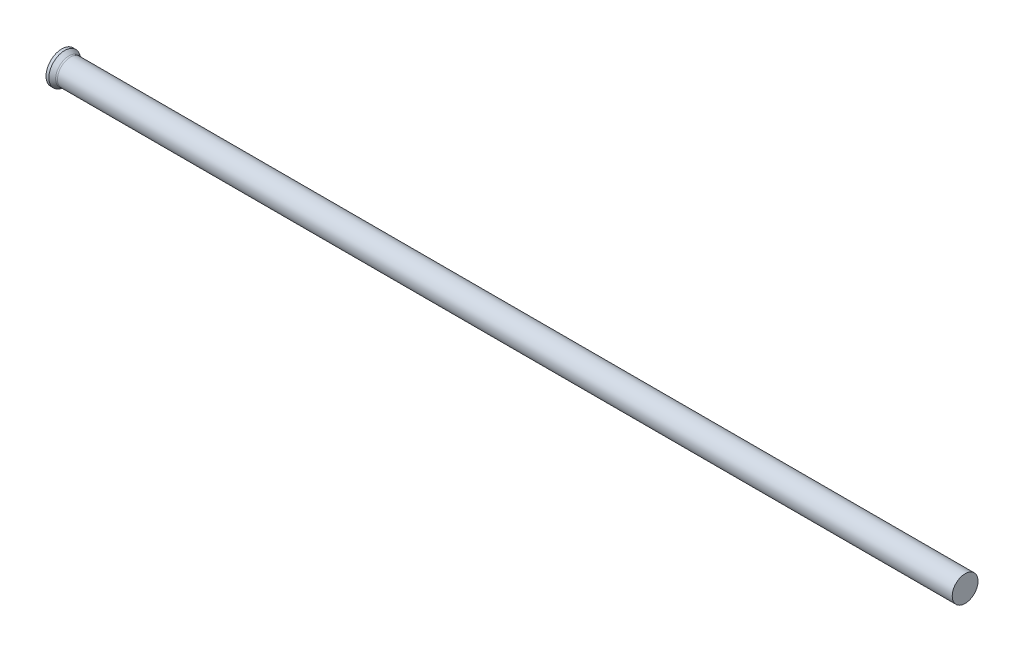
ISO-10303-21;
HEADER;
FILE_DESCRIPTION(('STEP AP214'),'2;1');
FILE_NAME('part.step','',(''),(''),'','','');
FILE_SCHEMA(('AUTOMOTIVE_DESIGN { 1 0 10303 214 1 1 1 1 }'));
ENDSEC;
DATA;
#1=APPLICATION_CONTEXT('core data for automotive mechanical design processes');
#2=APPLICATION_PROTOCOL_DEFINITION('international standard','automotive_design',2000,#1);
#3=PRODUCT_CONTEXT('',#1,'mechanical');
#4=PRODUCT('Part','Part','',(#3));
#5=PRODUCT_RELATED_PRODUCT_CATEGORY('part','',(#4));
#6=PRODUCT_DEFINITION_FORMATION('','',#4);
#7=PRODUCT_DEFINITION_CONTEXT('part definition',#1,'design');
#8=PRODUCT_DEFINITION('design','',#6,#7);
#9=PRODUCT_DEFINITION_SHAPE('','',#8);
#10=(LENGTH_UNIT() NAMED_UNIT(*) SI_UNIT(.MILLI.,.METRE.));
#11=(NAMED_UNIT(*) PLANE_ANGLE_UNIT() SI_UNIT($,.RADIAN.));
#12=(NAMED_UNIT(*) SI_UNIT($,.STERADIAN.) SOLID_ANGLE_UNIT());
#13=UNCERTAINTY_MEASURE_WITH_UNIT(LENGTH_MEASURE(1.E-05),#10,'distance_accuracy_value','');
#14=(GEOMETRIC_REPRESENTATION_CONTEXT(3) GLOBAL_UNCERTAINTY_ASSIGNED_CONTEXT((#13)) GLOBAL_UNIT_ASSIGNED_CONTEXT((#10,
#11,#12)) REPRESENTATION_CONTEXT('',''));
#15=CARTESIAN_POINT('',(0.,0.,0.));
#16=DIRECTION('',(0.,0.,1.));
#17=DIRECTION('',(1.,0.,0.));
#18=AXIS2_PLACEMENT_3D('',#15,#16,#17);
#19=CARTESIAN_POINT('',(0.,0.,0.));
#20=DIRECTION('',(1.,0.,0.));
#21=DIRECTION('',(0.,0.,-1.));
#22=AXIS2_PLACEMENT_3D('',#19,#20,#21);
#23=PLANE('',#22);
#24=CARTESIAN_POINT('',(0.,0.,0.));
#25=DIRECTION('',(-1.,0.,0.));
#26=DIRECTION('',(0.,0.,1.));
#27=AXIS2_PLACEMENT_3D('',#24,#25,#26);
#28=CIRCLE('',#27,5.5);
#29=CARTESIAN_POINT('',(0.,0.,5.5));
#30=VERTEX_POINT('',#29);
#31=EDGE_CURVE('E25',#30,#30,#28,.T.);
#32=ORIENTED_EDGE('',*,*,#31,.T.);
#33=EDGE_LOOP('',(#32));
#34=FACE_BOUND('',#33,.T.);
#35=ADVANCED_FACE('F14',(#34),#23,.F.);
#36=CARTESIAN_POINT('',(0.,0.,0.));
#37=DIRECTION('',(-1.,0.,0.));
#38=DIRECTION('',(0.,0.,1.));
#39=AXIS2_PLACEMENT_3D('',#36,#37,#38);
#40=CYLINDRICAL_SURFACE('',#39,5.5);
#41=ORIENTED_EDGE('',*,*,#31,.F.);
#42=EDGE_LOOP('',(#41));
#43=FACE_BOUND('',#42,.T.);
#44=CARTESIAN_POINT('',(0.997949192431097,0.,0.));
#45=DIRECTION('',(-1.,0.,0.));
#46=DIRECTION('',(0.,0.,1.));
#47=AXIS2_PLACEMENT_3D('',#44,#45,#46);
#48=CIRCLE('',#47,5.5);
#49=CARTESIAN_POINT('',(0.997949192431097,0.,5.5));
#50=VERTEX_POINT('',#49);
#51=EDGE_CURVE('E29',#50,#50,#48,.T.);
#52=ORIENTED_EDGE('',*,*,#51,.T.);
#53=EDGE_LOOP('',(#52));
#54=FACE_BOUND('',#53,.T.);
#55=ADVANCED_FACE('F53',(#43,#54),#40,.T.);
#56=CARTESIAN_POINT('',(2.73,0.,0.));
#57=DIRECTION('',(-1.,0.,0.));
#58=DIRECTION('',(0.,0.,1.));
#59=AXIS2_PLACEMENT_3D('',#56,#57,#58);
#60=CONICAL_SURFACE('',#59,4.5,0.523598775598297);
#61=CARTESIAN_POINT('',(2.49794919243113,0.,0.));
#62=DIRECTION('',(-1.,0.,0.));
#63=DIRECTION('',(0.,0.,1.));
#64=AXIS2_PLACEMENT_3D('',#61,#62,#63);
#65=CIRCLE('',#64,4.63397459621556);
#66=CARTESIAN_POINT('',(2.49794919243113,0.,4.63397459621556));
#67=VERTEX_POINT('',#66);
#68=EDGE_CURVE('E21',#67,#67,#65,.T.);
#69=ORIENTED_EDGE('',*,*,#68,.T.);
#70=EDGE_LOOP('',(#69));
#71=FACE_BOUND('',#70,.T.);
#72=ORIENTED_EDGE('',*,*,#51,.F.);
#73=EDGE_LOOP('',(#72));
#74=FACE_BOUND('',#73,.T.);
#75=ADVANCED_FACE('F50',(#71,#74),#60,.T.);
#76=CARTESIAN_POINT('',(0.,0.,0.));
#77=DIRECTION('',(-1.,0.,0.));
#78=DIRECTION('',(0.,0.,1.));
#79=AXIS2_PLACEMENT_3D('',#76,#77,#78);
#80=CYLINDRICAL_SURFACE('',#79,4.5);
#81=CARTESIAN_POINT('',(2.99794919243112,0.,0.));
#82=DIRECTION('',(-1.,0.,0.));
#83=DIRECTION('',(0.,0.,1.));
#84=AXIS2_PLACEMENT_3D('',#81,#82,#83);
#85=CIRCLE('',#84,4.5);
#86=CARTESIAN_POINT('',(2.99794919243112,0.,4.5));
#87=VERTEX_POINT('',#86);
#88=EDGE_CURVE('E9',#87,#87,#85,.F.);
#89=ORIENTED_EDGE('',*,*,#88,.T.);
#90=EDGE_LOOP('',(#89));
#91=FACE_BOUND('',#90,.T.);
#92=CARTESIAN_POINT('',(315.,0.,0.));
#93=DIRECTION('',(-1.,0.,0.));
#94=DIRECTION('',(0.,0.,1.));
#95=AXIS2_PLACEMENT_3D('',#92,#93,#94);
#96=CIRCLE('',#95,4.5);
#97=CARTESIAN_POINT('',(315.,0.,4.5));
#98=VERTEX_POINT('',#97);
#99=EDGE_CURVE('E34',#98,#98,#96,.T.);
#100=ORIENTED_EDGE('',*,*,#99,.T.);
#101=EDGE_LOOP('',(#100));
#102=FACE_BOUND('',#101,.T.);
#103=ADVANCED_FACE('F38',(#91,#102),#80,.T.);
#104=CARTESIAN_POINT('',(315.,4.5,0.));
#105=DIRECTION('',(-1.,0.,0.));
#106=DIRECTION('',(0.,0.,1.));
#107=AXIS2_PLACEMENT_3D('',#104,#105,#106);
#108=PLANE('',#107);
#109=ORIENTED_EDGE('',*,*,#99,.F.);
#110=EDGE_LOOP('',(#109));
#111=FACE_BOUND('',#110,.T.);
#112=ADVANCED_FACE('F40',(#111),#108,.F.);
#113=CARTESIAN_POINT('',(2.99794919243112,0.,0.));
#114=DIRECTION('',(-1.,0.,0.));
#115=DIRECTION('',(0.,0.,1.));
#116=AXIS2_PLACEMENT_3D('',#113,#114,#115);
#117=TOROIDAL_SURFACE('',#116,5.5,1.);
#118=ORIENTED_EDGE('',*,*,#88,.F.);
#119=EDGE_LOOP('',(#118));
#120=FACE_BOUND('',#119,.T.);
#121=ORIENTED_EDGE('',*,*,#68,.F.);
#122=EDGE_LOOP('',(#121));
#123=FACE_BOUND('',#122,.T.);
#124=ADVANCED_FACE('F16',(#120,#123),#117,.F.);
#125=CLOSED_SHELL('',(#35,#55,#75,#103,#112,#124));
#126=MANIFOLD_SOLID_BREP('B1',#125);
#127=ADVANCED_BREP_SHAPE_REPRESENTATION('',(#18,#126),#14);
#128=SHAPE_DEFINITION_REPRESENTATION(#9,#127);
ENDSEC;
END-ISO-10303-21;
